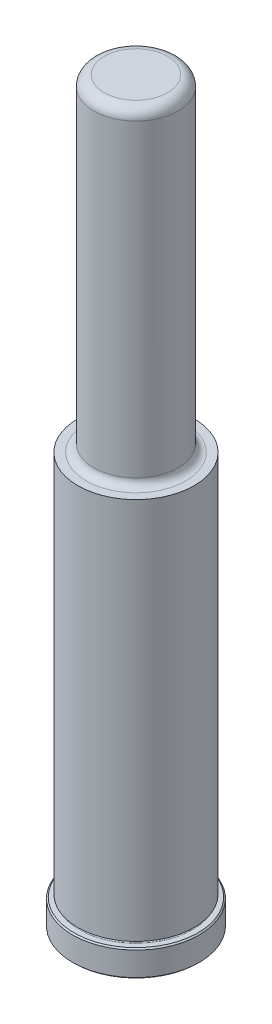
ISO-10303-21;
HEADER;
FILE_DESCRIPTION(('STEP AP214'),'2;1');
FILE_NAME('part.step','',(''),(''),'','','');
FILE_SCHEMA(('AUTOMOTIVE_DESIGN { 1 0 10303 214 1 1 1 1 }'));
ENDSEC;
DATA;
#1=APPLICATION_CONTEXT('core data for automotive mechanical design processes');
#2=APPLICATION_PROTOCOL_DEFINITION('international standard','automotive_design',2000,#1);
#3=PRODUCT_CONTEXT('',#1,'mechanical');
#4=PRODUCT('Part','Part','',(#3));
#5=PRODUCT_RELATED_PRODUCT_CATEGORY('part','',(#4));
#6=PRODUCT_DEFINITION_FORMATION('','',#4);
#7=PRODUCT_DEFINITION_CONTEXT('part definition',#1,'design');
#8=PRODUCT_DEFINITION('design','',#6,#7);
#9=PRODUCT_DEFINITION_SHAPE('','',#8);
#10=(LENGTH_UNIT() NAMED_UNIT(*) SI_UNIT(.MILLI.,.METRE.));
#11=(NAMED_UNIT(*) PLANE_ANGLE_UNIT() SI_UNIT($,.RADIAN.));
#12=(NAMED_UNIT(*) SI_UNIT($,.STERADIAN.) SOLID_ANGLE_UNIT());
#13=UNCERTAINTY_MEASURE_WITH_UNIT(LENGTH_MEASURE(1.E-05),#10,'distance_accuracy_value','');
#14=(GEOMETRIC_REPRESENTATION_CONTEXT(3) GLOBAL_UNCERTAINTY_ASSIGNED_CONTEXT((#13)) GLOBAL_UNIT_ASSIGNED_CONTEXT((#10,
#11,#12)) REPRESENTATION_CONTEXT('',''));
#15=CARTESIAN_POINT('',(0.,0.,0.));
#16=DIRECTION('',(0.,0.,1.));
#17=DIRECTION('',(1.,0.,0.));
#18=AXIS2_PLACEMENT_3D('',#15,#16,#17);
#19=CARTESIAN_POINT('',(0.,0.,0.));
#20=DIRECTION('',(0.,1.,0.));
#21=DIRECTION('',(0.,0.,1.));
#22=AXIS2_PLACEMENT_3D('',#19,#20,#21);
#23=PLANE('',#22);
#24=CARTESIAN_POINT('',(0.,0.,0.));
#25=DIRECTION('',(0.,1.,0.));
#26=DIRECTION('',(0.,0.,1.));
#27=AXIS2_PLACEMENT_3D('',#24,#25,#26);
#28=CIRCLE('',#27,18.669);
#29=CARTESIAN_POINT('',(0.,0.,18.669));
#30=VERTEX_POINT('',#29);
#31=EDGE_CURVE('E46',#30,#30,#28,.F.);
#32=ORIENTED_EDGE('',*,*,#31,.T.);
#33=EDGE_LOOP('',(#32));
#34=FACE_BOUND('',#33,.T.);
#35=ADVANCED_FACE('F31',(#34),#23,.F.);
#36=CARTESIAN_POINT('',(0.,0.,0.));
#37=DIRECTION('',(0.,1.,0.));
#38=DIRECTION('',(0.,0.,1.));
#39=AXIS2_PLACEMENT_3D('',#36,#37,#38);
#40=CYLINDRICAL_SURFACE('',#39,19.05);
#41=CARTESIAN_POINT('',(0.,0.380999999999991,0.));
#42=DIRECTION('',(0.,1.,0.));
#43=DIRECTION('',(0.,0.,1.));
#44=AXIS2_PLACEMENT_3D('',#41,#42,#43);
#45=CIRCLE('',#44,19.05);
#46=CARTESIAN_POINT('',(0.,0.380999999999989,19.05));
#47=VERTEX_POINT('',#46);
#48=EDGE_CURVE('E51',#47,#47,#45,.T.);
#49=ORIENTED_EDGE('',*,*,#48,.T.);
#50=EDGE_LOOP('',(#49));
#51=FACE_BOUND('',#50,.T.);
#52=CARTESIAN_POINT('',(0.,7.54379999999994,0.));
#53=DIRECTION('',(0.,-1.,0.));
#54=DIRECTION('',(0.,0.,-1.));
#55=AXIS2_PLACEMENT_3D('',#52,#53,#54);
#56=CIRCLE('',#55,19.05);
#57=CARTESIAN_POINT('',(0.,7.54379999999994,-19.05));
#58=VERTEX_POINT('',#57);
#59=EDGE_CURVE('E54',#58,#58,#56,.T.);
#60=ORIENTED_EDGE('',*,*,#59,.T.);
#61=EDGE_LOOP('',(#60));
#62=FACE_BOUND('',#61,.T.);
#63=ADVANCED_FACE('F110',(#51,#62),#40,.T.);
#64=CARTESIAN_POINT('',(0.,7.9248,-19.05));
#65=DIRECTION('',(0.,-1.,0.));
#66=DIRECTION('',(0.,0.,-1.));
#67=AXIS2_PLACEMENT_3D('',#64,#65,#66);
#68=PLANE('',#67);
#69=CARTESIAN_POINT('',(0.,7.9248,0.));
#70=DIRECTION('',(0.,-1.,0.));
#71=DIRECTION('',(0.,0.,-1.));
#72=AXIS2_PLACEMENT_3D('',#69,#70,#71);
#73=CIRCLE('',#72,18.6689999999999);
#74=CARTESIAN_POINT('',(0.,7.9248,-18.6689999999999));
#75=VERTEX_POINT('',#74);
#76=EDGE_CURVE('E42',#75,#75,#73,.F.);
#77=ORIENTED_EDGE('',*,*,#76,.T.);
#78=EDGE_LOOP('',(#77));
#79=FACE_BOUND('',#78,.T.);
#80=CARTESIAN_POINT('',(0.,7.9248,0.));
#81=DIRECTION('',(0.,1.,0.));
#82=DIRECTION('',(0.,0.,1.));
#83=AXIS2_PLACEMENT_3D('',#80,#81,#82);
#84=CIRCLE('',#83,17.0688);
#85=CARTESIAN_POINT('',(0.,7.92479999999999,17.0688));
#86=VERTEX_POINT('',#85);
#87=EDGE_CURVE('E57',#86,#86,#84,.T.);
#88=ORIENTED_EDGE('',*,*,#87,.F.);
#89=EDGE_LOOP('',(#88));
#90=FACE_BOUND('',#89,.T.);
#91=ADVANCED_FACE('F105',(#79,#90),#68,.F.);
#92=CARTESIAN_POINT('',(0.,8.3058,0.));
#93=DIRECTION('',(0.,1.,0.));
#94=DIRECTION('',(0.,0.,1.));
#95=AXIS2_PLACEMENT_3D('',#92,#93,#94);
#96=TOROIDAL_SURFACE('',#95,17.0688,0.381000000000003);
#97=CARTESIAN_POINT('',(0.,8.6868,0.));
#98=DIRECTION('',(0.,1.,0.));
#99=DIRECTION('',(0.,0.,1.));
#100=AXIS2_PLACEMENT_3D('',#97,#98,#99);
#101=CIRCLE('',#100,17.0688);
#102=CARTESIAN_POINT('',(0.,8.6868,17.0688));
#103=VERTEX_POINT('',#102);
#104=EDGE_CURVE('E60',#103,#103,#101,.T.);
#105=ORIENTED_EDGE('',*,*,#104,.F.);
#106=EDGE_LOOP('',(#105));
#107=FACE_BOUND('',#106,.T.);
#108=ORIENTED_EDGE('',*,*,#87,.T.);
#109=EDGE_LOOP('',(#108));
#110=FACE_BOUND('',#109,.T.);
#111=ADVANCED_FACE('F99',(#107,#110),#96,.F.);
#112=CARTESIAN_POINT('',(0.,8.6868,-17.0688));
#113=DIRECTION('',(0.,1.,0.));
#114=DIRECTION('',(0.,0.,1.));
#115=AXIS2_PLACEMENT_3D('',#112,#113,#114);
#116=PLANE('',#115);
#117=CARTESIAN_POINT('',(0.,8.6868,0.));
#118=DIRECTION('',(0.,1.,0.));
#119=DIRECTION('',(0.,0.,1.));
#120=AXIS2_PLACEMENT_3D('',#117,#118,#119);
#121=CIRCLE('',#120,17.4752);
#122=CARTESIAN_POINT('',(0.,8.6868,17.4752));
#123=VERTEX_POINT('',#122);
#124=EDGE_CURVE('E63',#123,#123,#121,.T.);
#125=ORIENTED_EDGE('',*,*,#124,.F.);
#126=EDGE_LOOP('',(#125));
#127=FACE_BOUND('',#126,.T.);
#128=ORIENTED_EDGE('',*,*,#104,.T.);
#129=EDGE_LOOP('',(#128));
#130=FACE_BOUND('',#129,.T.);
#131=ADVANCED_FACE('F93',(#127,#130),#116,.F.);
#132=CARTESIAN_POINT('',(0.,0.,0.));
#133=DIRECTION('',(0.,1.,0.));
#134=DIRECTION('',(0.,0.,1.));
#135=AXIS2_PLACEMENT_3D('',#132,#133,#134);
#136=CYLINDRICAL_SURFACE('',#135,17.4752);
#137=CARTESIAN_POINT('',(0.,123.825,0.));
#138=DIRECTION('',(0.,1.,0.));
#139=DIRECTION('',(0.,0.,1.));
#140=AXIS2_PLACEMENT_3D('',#137,#138,#139);
#141=CIRCLE('',#140,17.4752);
#142=CARTESIAN_POINT('',(0.,123.825,17.4752));
#143=VERTEX_POINT('',#142);
#144=EDGE_CURVE('E66',#143,#143,#141,.T.);
#145=ORIENTED_EDGE('',*,*,#144,.F.);
#146=EDGE_LOOP('',(#145));
#147=FACE_BOUND('',#146,.T.);
#148=ORIENTED_EDGE('',*,*,#124,.T.);
#149=EDGE_LOOP('',(#148));
#150=FACE_BOUND('',#149,.T.);
#151=ADVANCED_FACE('F87',(#147,#150),#136,.T.);
#152=CARTESIAN_POINT('',(0.,123.825,-17.4752));
#153=DIRECTION('',(0.,-1.,0.));
#154=DIRECTION('',(0.,0.,-1.));
#155=AXIS2_PLACEMENT_3D('',#152,#153,#154);
#156=PLANE('',#155);
#157=CARTESIAN_POINT('',(0.,123.825,0.));
#158=DIRECTION('',(0.,1.,0.));
#159=DIRECTION('',(0.,0.,1.));
#160=AXIS2_PLACEMENT_3D('',#157,#158,#159);
#161=CIRCLE('',#160,14.9733);
#162=CARTESIAN_POINT('',(0.,123.825,14.9733));
#163=VERTEX_POINT('',#162);
#164=EDGE_CURVE('E69',#163,#163,#161,.T.);
#165=ORIENTED_EDGE('',*,*,#164,.F.);
#166=EDGE_LOOP('',(#165));
#167=FACE_BOUND('',#166,.T.);
#168=ORIENTED_EDGE('',*,*,#144,.T.);
#169=EDGE_LOOP('',(#168));
#170=FACE_BOUND('',#169,.T.);
#171=ADVANCED_FACE('F81',(#167,#170),#156,.F.);
#172=CARTESIAN_POINT('',(0.,126.111,0.));
#173=DIRECTION('',(0.,1.,0.));
#174=DIRECTION('',(0.,0.,1.));
#175=AXIS2_PLACEMENT_3D('',#172,#173,#174);
#176=TOROIDAL_SURFACE('',#175,14.9733,2.28600000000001);
#177=CARTESIAN_POINT('',(0.,126.111,0.));
#178=DIRECTION('',(0.,1.,0.));
#179=DIRECTION('',(0.,0.,1.));
#180=AXIS2_PLACEMENT_3D('',#177,#178,#179);
#181=CIRCLE('',#180,12.6873);
#182=CARTESIAN_POINT('',(0.,126.111,12.6873));
#183=VERTEX_POINT('',#182);
#184=EDGE_CURVE('E72',#183,#183,#181,.T.);
#185=ORIENTED_EDGE('',*,*,#184,.F.);
#186=EDGE_LOOP('',(#185));
#187=FACE_BOUND('',#186,.T.);
#188=ORIENTED_EDGE('',*,*,#164,.T.);
#189=EDGE_LOOP('',(#188));
#190=FACE_BOUND('',#189,.T.);
#191=ADVANCED_FACE('F78',(#187,#190),#176,.F.);
#192=CARTESIAN_POINT('',(0.,0.,0.));
#193=DIRECTION('',(0.,1.,0.));
#194=DIRECTION('',(0.,0.,1.));
#195=AXIS2_PLACEMENT_3D('',#192,#193,#194);
#196=CYLINDRICAL_SURFACE('',#195,12.6873);
#197=CARTESIAN_POINT('',(0.,219.075,0.));
#198=DIRECTION('',(0.,-1.,0.));
#199=DIRECTION('',(0.,0.,-1.));
#200=AXIS2_PLACEMENT_3D('',#197,#198,#199);
#201=CIRCLE('',#200,12.6873);
#202=CARTESIAN_POINT('',(0.,219.075,-12.6873));
#203=VERTEX_POINT('',#202);
#204=EDGE_CURVE('E10',#203,#203,#201,.T.);
#205=ORIENTED_EDGE('',*,*,#204,.T.);
#206=EDGE_LOOP('',(#205));
#207=FACE_BOUND('',#206,.T.);
#208=ORIENTED_EDGE('',*,*,#184,.T.);
#209=EDGE_LOOP('',(#208));
#210=FACE_BOUND('',#209,.T.);
#211=ADVANCED_FACE('F76',(#207,#210),#196,.T.);
#212=CARTESIAN_POINT('',(0.,222.25,-12.6873));
#213=DIRECTION('',(0.,-1.,0.));
#214=DIRECTION('',(0.,0.,-1.));
#215=AXIS2_PLACEMENT_3D('',#212,#213,#214);
#216=PLANE('',#215);
#217=CARTESIAN_POINT('',(0.,222.25,0.));
#218=DIRECTION('',(0.,-1.,0.));
#219=DIRECTION('',(0.,0.,-1.));
#220=AXIS2_PLACEMENT_3D('',#217,#218,#219);
#221=CIRCLE('',#220,9.5123);
#222=CARTESIAN_POINT('',(0.,222.25,-9.51229999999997));
#223=VERTEX_POINT('',#222);
#224=EDGE_CURVE('E38',#223,#223,#221,.F.);
#225=ORIENTED_EDGE('',*,*,#224,.T.);
#226=EDGE_LOOP('',(#225));
#227=FACE_BOUND('',#226,.T.);
#228=ADVANCED_FACE('F127',(#227),#216,.F.);
#229=CARTESIAN_POINT('',(0.,0.380999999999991,0.));
#230=DIRECTION('',(0.,1.,0.));
#231=DIRECTION('',(0.,0.,1.));
#232=AXIS2_PLACEMENT_3D('',#229,#230,#231);
#233=CONICAL_SURFACE('',#232,19.05,0.785398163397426);
#234=CARTESIAN_POINT('',(0.,0.,18.669));
#235=CARTESIAN_POINT('',(0.,0.00396874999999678,18.67296875));
#236=CARTESIAN_POINT('',(0.,0.0079374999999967,18.6769375));
#237=CARTESIAN_POINT('',(0.,0.0158749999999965,18.684875));
#238=CARTESIAN_POINT('',(0.,0.0198437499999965,18.68884375));
#239=CARTESIAN_POINT('',(0.,0.0277812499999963,18.69678125));
#240=CARTESIAN_POINT('',(0.,0.0317499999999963,18.70075));
#241=CARTESIAN_POINT('',(0.,0.039687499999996,18.7086875));
#242=CARTESIAN_POINT('',(0.,0.0436562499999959,18.71265625));
#243=CARTESIAN_POINT('',(0.,0.0515937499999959,18.72059375));
#244=CARTESIAN_POINT('',(0.,0.0555624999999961,18.7245625));
#245=CARTESIAN_POINT('',(0.,0.0634999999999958,18.7325));
#246=CARTESIAN_POINT('',(0.,0.0674687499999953,18.73646875));
#247=CARTESIAN_POINT('',(0.,0.075406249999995,18.74440625));
#248=CARTESIAN_POINT('',(0.,0.0793749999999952,18.748375));
#249=CARTESIAN_POINT('',(0.,0.0873124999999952,18.7563125));
#250=CARTESIAN_POINT('',(0.,0.0912812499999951,18.76028125));
#251=CARTESIAN_POINT('',(0.,0.0992187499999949,18.76821875));
#252=CARTESIAN_POINT('',(0.,0.103187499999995,18.7721875));
#253=CARTESIAN_POINT('',(0.,0.111124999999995,18.780125));
#254=CARTESIAN_POINT('',(0.,0.115093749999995,18.78409375));
#255=CARTESIAN_POINT('',(0.,0.123031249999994,18.79203125));
#256=CARTESIAN_POINT('',(0.,0.126999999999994,18.796));
#257=CARTESIAN_POINT('',(0.,0.134937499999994,18.8039375));
#258=CARTESIAN_POINT('',(0.,0.138906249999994,18.80790625));
#259=CARTESIAN_POINT('',(0.,0.146843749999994,18.81584375));
#260=CARTESIAN_POINT('',(0.,0.150812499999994,18.8198125));
#261=CARTESIAN_POINT('',(0.,0.158749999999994,18.82775));
#262=CARTESIAN_POINT('',(0.,0.162718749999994,18.83171875));
#263=CARTESIAN_POINT('',(0.,0.170656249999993,18.83965625));
#264=CARTESIAN_POINT('',(0.,0.174624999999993,18.843625));
#265=CARTESIAN_POINT('',(0.,0.182562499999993,18.8515625));
#266=CARTESIAN_POINT('',(0.,0.186531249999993,18.85553125));
#267=CARTESIAN_POINT('',(0.,0.194468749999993,18.86346875));
#268=CARTESIAN_POINT('',(0.,0.198437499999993,18.8674375));
#269=CARTESIAN_POINT('',(0.,0.206374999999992,18.875375));
#270=CARTESIAN_POINT('',(0.,0.210343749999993,18.87934375));
#271=CARTESIAN_POINT('',(0.,0.218281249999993,18.88728125));
#272=CARTESIAN_POINT('',(0.,0.222249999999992,18.89125));
#273=CARTESIAN_POINT('',(0.,0.230187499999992,18.8991875));
#274=CARTESIAN_POINT('',(0.,0.234156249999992,18.90315625));
#275=CARTESIAN_POINT('',(0.,0.242093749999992,18.91109375));
#276=CARTESIAN_POINT('',(0.,0.246062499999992,18.9150625));
#277=CARTESIAN_POINT('',(0.,0.253999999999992,18.923));
#278=CARTESIAN_POINT('',(0.,0.257968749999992,18.92696875));
#279=CARTESIAN_POINT('',(0.,0.265906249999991,18.93490625));
#280=CARTESIAN_POINT('',(0.,0.269874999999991,18.938875));
#281=CARTESIAN_POINT('',(0.,0.277812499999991,18.9468125));
#282=CARTESIAN_POINT('',(0.,0.281781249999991,18.95078125));
#283=CARTESIAN_POINT('',(0.,0.289718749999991,18.95871875));
#284=CARTESIAN_POINT('',(0.,0.293687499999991,18.9626875));
#285=CARTESIAN_POINT('',(0.,0.301624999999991,18.970625));
#286=CARTESIAN_POINT('',(0.,0.305593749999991,18.97459375));
#287=CARTESIAN_POINT('',(0.,0.313531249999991,18.98253125));
#288=CARTESIAN_POINT('',(0.,0.31749999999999,18.9865));
#289=CARTESIAN_POINT('',(0.,0.32543749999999,18.9944375));
#290=CARTESIAN_POINT('',(0.,0.32940624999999,18.99840625));
#291=CARTESIAN_POINT('',(0.,0.33734374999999,19.00634375));
#292=CARTESIAN_POINT('',(0.,0.34131249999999,19.0103125));
#293=CARTESIAN_POINT('',(0.,0.34924999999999,19.01825));
#294=CARTESIAN_POINT('',(0.,0.35321874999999,19.02221875));
#295=CARTESIAN_POINT('',(0.,0.36115624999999,19.03015625));
#296=CARTESIAN_POINT('',(0.,0.365124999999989,19.034125));
#297=CARTESIAN_POINT('',(0.,0.373062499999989,19.0420625));
#298=CARTESIAN_POINT('',(0.,0.377031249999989,19.04603125));
#299=CARTESIAN_POINT('',(0.,0.380999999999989,19.05));
#300=B_SPLINE_CURVE_WITH_KNOTS('',3,(#234,#235,#236,#237,#238,#239,#240,#241,#242,#243,#244,
#245,#246,#247,#248,#249,#250,#251,#252,#253,#254,#255,#256,#257,#258,#259,#260,#261,#262,#263,
#264,#265,#266,#267,#268,#269,#270,#271,#272,#273,#274,#275,#276,#277,#278,#279,#280,#281,#282,
#283,#284,#285,#286,#287,#288,#289,#290,#291,#292,#293,#294,#295,#296,#297,#298,#299),
.UNSPECIFIED.,.F.,.F.,(4,2,2,2,2,2,2,2,2,2,2,2,2,2,2,2,2,2,2,2,2,2,2,2,2,2,2,2,2,2,2,2,4),(0.,
0.0168379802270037,0.0336759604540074,0.0505139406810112,0.0673519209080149,0.0841899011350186,
0.101027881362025,0.117865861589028,0.134703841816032,0.151541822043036,0.16837980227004,
0.185217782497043,0.202055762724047,0.218893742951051,0.235731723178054,0.252569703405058,
0.269407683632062,0.286245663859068,0.303083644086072,0.319921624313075,0.336759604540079,
0.353597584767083,0.370435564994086,0.38727354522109,0.404111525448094,0.420949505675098,
0.437787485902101,0.454625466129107,0.471463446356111,0.488301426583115,0.505139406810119,
0.521977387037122,0.538815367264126),.UNSPECIFIED.);
#301=EDGE_CURVE('BSEAM124',#30,#47,#300,.T.);
#302=ORIENTED_EDGE('',*,*,#31,.F.);
#303=ORIENTED_EDGE('',*,*,#48,.F.);
#304=ORIENTED_EDGE('',*,*,#301,.T.);
#305=ORIENTED_EDGE('',*,*,#301,.F.);
#306=EDGE_LOOP('',(#302,#304,#303,#305));
#307=FACE_BOUND('',#306,.T.);
#308=ADVANCED_FACE('F124',(#307),#233,.T.);
#309=CARTESIAN_POINT('',(0.,7.9248,0.));
#310=DIRECTION('',(0.,-1.,0.));
#311=DIRECTION('',(0.,0.,-1.));
#312=AXIS2_PLACEMENT_3D('',#309,#310,#311);
#313=CONICAL_SURFACE('',#312,18.6689999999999,0.785398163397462);
#314=ORIENTED_EDGE('',*,*,#59,.F.);
#315=EDGE_LOOP('',(#314));
#316=FACE_BOUND('',#315,.T.);
#317=ORIENTED_EDGE('',*,*,#76,.F.);
#318=EDGE_LOOP('',(#317));
#319=FACE_BOUND('',#318,.T.);
#320=ADVANCED_FACE('F126',(#316,#319),#313,.T.);
#321=CARTESIAN_POINT('',(0.,219.075,0.));
#322=DIRECTION('',(0.,-1.,0.));
#323=DIRECTION('',(0.,0.,-1.));
#324=AXIS2_PLACEMENT_3D('',#321,#322,#323);
#325=TOROIDAL_SURFACE('',#324,9.5123,3.175);
#326=ORIENTED_EDGE('',*,*,#204,.F.);
#327=EDGE_LOOP('',(#326));
#328=FACE_BOUND('',#327,.T.);
#329=ORIENTED_EDGE('',*,*,#224,.F.);
#330=EDGE_LOOP('',(#329));
#331=FACE_BOUND('',#330,.T.);
#332=ADVANCED_FACE('F33',(#328,#331),#325,.T.);
#333=CLOSED_SHELL('',(#35,#63,#91,#111,#131,#151,#171,#191,#211,#228,#308,#320,#332));
#334=MANIFOLD_SOLID_BREP('B2',#333);
#335=ADVANCED_BREP_SHAPE_REPRESENTATION('',(#18,#334),#14);
#336=SHAPE_DEFINITION_REPRESENTATION(#9,#335);
ENDSEC;
END-ISO-10303-21;
